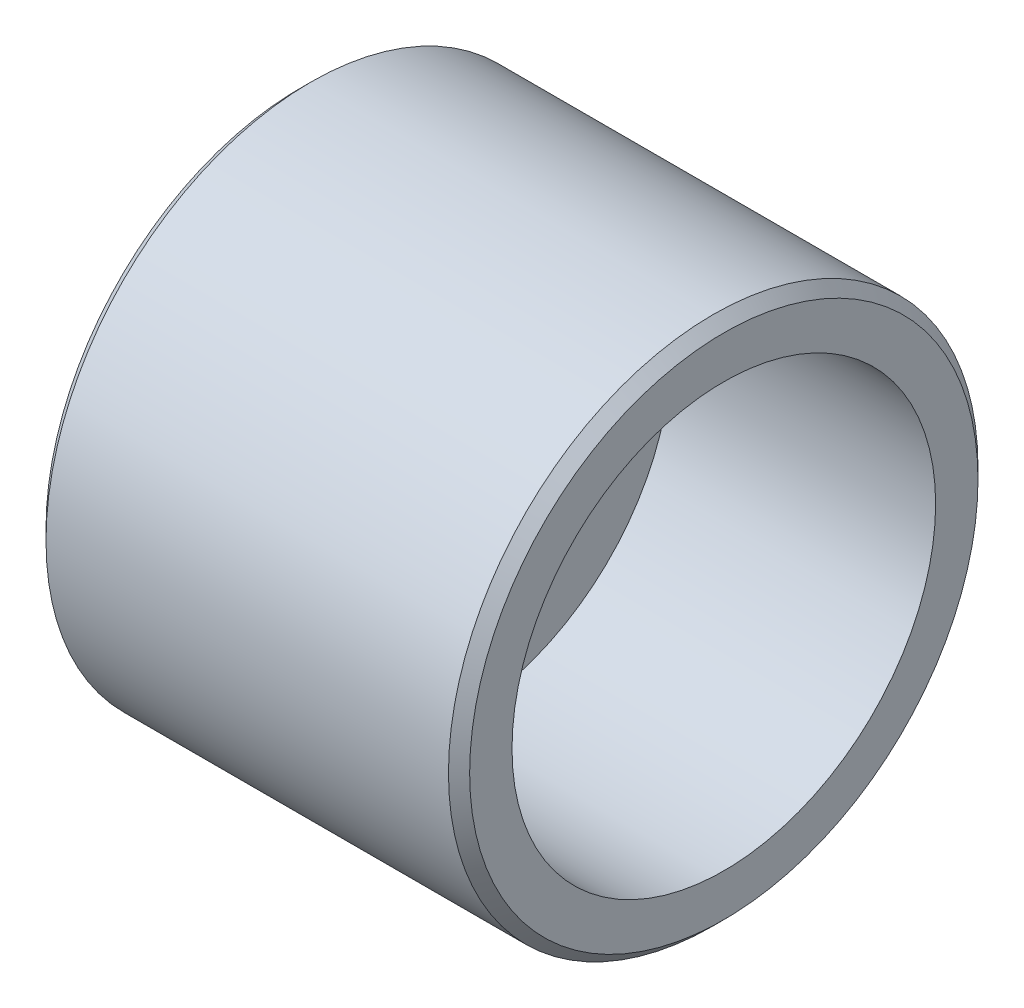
ISO-10303-21;
HEADER;
FILE_DESCRIPTION(('STEP AP214'),'2;1');
FILE_NAME('part.step','',(''),(''),'','','');
FILE_SCHEMA(('AUTOMOTIVE_DESIGN { 1 0 10303 214 1 1 1 1 }'));
ENDSEC;
DATA;
#1=APPLICATION_CONTEXT('core data for automotive mechanical design processes');
#2=APPLICATION_PROTOCOL_DEFINITION('international standard','automotive_design',2000,#1);
#3=PRODUCT_CONTEXT('',#1,'mechanical');
#4=PRODUCT('Part','Part','',(#3));
#5=PRODUCT_RELATED_PRODUCT_CATEGORY('part','',(#4));
#6=PRODUCT_DEFINITION_FORMATION('','',#4);
#7=PRODUCT_DEFINITION_CONTEXT('part definition',#1,'design');
#8=PRODUCT_DEFINITION('design','',#6,#7);
#9=PRODUCT_DEFINITION_SHAPE('','',#8);
#10=(LENGTH_UNIT() NAMED_UNIT(*) SI_UNIT(.MILLI.,.METRE.));
#11=(NAMED_UNIT(*) PLANE_ANGLE_UNIT() SI_UNIT($,.RADIAN.));
#12=(NAMED_UNIT(*) SI_UNIT($,.STERADIAN.) SOLID_ANGLE_UNIT());
#13=UNCERTAINTY_MEASURE_WITH_UNIT(LENGTH_MEASURE(1.E-05),#10,'distance_accuracy_value','');
#14=(GEOMETRIC_REPRESENTATION_CONTEXT(3) GLOBAL_UNCERTAINTY_ASSIGNED_CONTEXT((#13)) GLOBAL_UNIT_ASSIGNED_CONTEXT((#10,
#11,#12)) REPRESENTATION_CONTEXT('',''));
#15=CARTESIAN_POINT('',(0.,0.,0.));
#16=DIRECTION('',(0.,0.,1.));
#17=DIRECTION('',(1.,0.,0.));
#18=AXIS2_PLACEMENT_3D('',#15,#16,#17);
#19=CARTESIAN_POINT('',(0.,16.,0.));
#20=DIRECTION('',(1.,0.,0.));
#21=DIRECTION('',(0.,0.,-1.));
#22=AXIS2_PLACEMENT_3D('',#19,#20,#21);
#23=PLANE('',#22);
#24=CARTESIAN_POINT('',(0.,0.,0.));
#25=DIRECTION('',(1.,0.,0.));
#26=DIRECTION('',(0.,0.,-1.));
#27=AXIS2_PLACEMENT_3D('',#24,#25,#26);
#28=CIRCLE('',#27,24.);
#29=CARTESIAN_POINT('',(0.,0.,-24.));
#30=VERTEX_POINT('',#29);
#31=EDGE_CURVE('E47',#30,#30,#28,.F.);
#32=ORIENTED_EDGE('',*,*,#31,.T.);
#33=EDGE_LOOP('',(#32));
#34=FACE_BOUND('',#33,.T.);
#35=CARTESIAN_POINT('',(0.,0.,0.));
#36=DIRECTION('',(-1.,0.,0.));
#37=DIRECTION('',(0.,0.,1.));
#38=AXIS2_PLACEMENT_3D('',#35,#36,#37);
#39=CIRCLE('',#38,16.);
#40=CARTESIAN_POINT('',(0.,0.,16.));
#41=VERTEX_POINT('',#40);
#42=EDGE_CURVE('E67',#41,#41,#39,.T.);
#43=ORIENTED_EDGE('',*,*,#42,.F.);
#44=EDGE_LOOP('',(#43));
#45=FACE_BOUND('',#44,.T.);
#46=ADVANCED_FACE('F32',(#34,#45),#23,.F.);
#47=CARTESIAN_POINT('',(0.,0.,0.));
#48=DIRECTION('',(-1.,0.,0.));
#49=DIRECTION('',(0.,0.,1.));
#50=AXIS2_PLACEMENT_3D('',#47,#48,#49);
#51=CYLINDRICAL_SURFACE('',#50,25.);
#52=CARTESIAN_POINT('',(1.00000000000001,0.,0.));
#53=DIRECTION('',(1.,0.,0.));
#54=DIRECTION('',(0.,0.,-1.));
#55=AXIS2_PLACEMENT_3D('',#52,#53,#54);
#56=CIRCLE('',#55,25.);
#57=CARTESIAN_POINT('',(1.00000000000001,0.,-25.));
#58=VERTEX_POINT('',#57);
#59=EDGE_CURVE('E39',#58,#58,#56,.T.);
#60=ORIENTED_EDGE('',*,*,#59,.T.);
#61=EDGE_LOOP('',(#60));
#62=FACE_BOUND('',#61,.T.);
#63=CARTESIAN_POINT('',(39.,0.,0.));
#64=DIRECTION('',(-1.,0.,0.));
#65=DIRECTION('',(0.,0.,1.));
#66=AXIS2_PLACEMENT_3D('',#63,#64,#65);
#67=CIRCLE('',#66,25.);
#68=CARTESIAN_POINT('',(39.,0.,25.));
#69=VERTEX_POINT('',#68);
#70=EDGE_CURVE('E43',#69,#69,#67,.T.);
#71=ORIENTED_EDGE('',*,*,#70,.T.);
#72=EDGE_LOOP('',(#71));
#73=FACE_BOUND('',#72,.T.);
#74=ADVANCED_FACE('F74',(#62,#73),#51,.T.);
#75=CARTESIAN_POINT('',(40.,25.,0.));
#76=DIRECTION('',(-1.,0.,0.));
#77=DIRECTION('',(0.,0.,1.));
#78=AXIS2_PLACEMENT_3D('',#75,#76,#77);
#79=PLANE('',#78);
#80=CARTESIAN_POINT('',(40.,0.,0.));
#81=DIRECTION('',(-1.,0.,0.));
#82=DIRECTION('',(0.,0.,1.));
#83=AXIS2_PLACEMENT_3D('',#80,#81,#82);
#84=CIRCLE('',#83,24.);
#85=CARTESIAN_POINT('',(40.,0.,24.));
#86=VERTEX_POINT('',#85);
#87=EDGE_CURVE('E10',#86,#86,#84,.F.);
#88=ORIENTED_EDGE('',*,*,#87,.T.);
#89=EDGE_LOOP('',(#88));
#90=FACE_BOUND('',#89,.T.);
#91=CARTESIAN_POINT('',(40.,0.,0.));
#92=DIRECTION('',(-1.,0.,0.));
#93=DIRECTION('',(0.,0.,1.));
#94=AXIS2_PLACEMENT_3D('',#91,#92,#93);
#95=CIRCLE('',#94,20.);
#96=CARTESIAN_POINT('',(40.,0.,20.));
#97=VERTEX_POINT('',#96);
#98=EDGE_CURVE('E52',#97,#97,#95,.T.);
#99=ORIENTED_EDGE('',*,*,#98,.T.);
#100=EDGE_LOOP('',(#99));
#101=FACE_BOUND('',#100,.T.);
#102=ADVANCED_FACE('F80',(#90,#101),#79,.F.);
#103=CARTESIAN_POINT('',(0.,0.,0.));
#104=DIRECTION('',(-1.,0.,0.));
#105=DIRECTION('',(0.,0.,1.));
#106=AXIS2_PLACEMENT_3D('',#103,#104,#105);
#107=CYLINDRICAL_SURFACE('',#106,20.);
#108=ORIENTED_EDGE('',*,*,#98,.F.);
#109=EDGE_LOOP('',(#108));
#110=FACE_BOUND('',#109,.T.);
#111=CARTESIAN_POINT('',(15.,0.,0.));
#112=DIRECTION('',(-1.,0.,0.));
#113=DIRECTION('',(0.,0.,1.));
#114=AXIS2_PLACEMENT_3D('',#111,#112,#113);
#115=CIRCLE('',#114,20.);
#116=CARTESIAN_POINT('',(15.,0.,20.));
#117=VERTEX_POINT('',#116);
#118=EDGE_CURVE('E55',#117,#117,#115,.T.);
#119=ORIENTED_EDGE('',*,*,#118,.T.);
#120=EDGE_LOOP('',(#119));
#121=FACE_BOUND('',#120,.T.);
#122=ADVANCED_FACE('F110',(#110,#121),#107,.F.);
#123=CARTESIAN_POINT('',(15.,20.,0.));
#124=DIRECTION('',(-1.,0.,0.));
#125=DIRECTION('',(0.,0.,1.));
#126=AXIS2_PLACEMENT_3D('',#123,#124,#125);
#127=PLANE('',#126);
#128=ORIENTED_EDGE('',*,*,#118,.F.);
#129=EDGE_LOOP('',(#128));
#130=FACE_BOUND('',#129,.T.);
#131=CARTESIAN_POINT('',(15.,0.,0.));
#132=DIRECTION('',(-1.,0.,0.));
#133=DIRECTION('',(0.,0.,1.));
#134=AXIS2_PLACEMENT_3D('',#131,#132,#133);
#135=CIRCLE('',#134,12.5);
#136=CARTESIAN_POINT('',(15.,0.,12.5));
#137=VERTEX_POINT('',#136);
#138=EDGE_CURVE('E58',#137,#137,#135,.T.);
#139=ORIENTED_EDGE('',*,*,#138,.T.);
#140=EDGE_LOOP('',(#139));
#141=FACE_BOUND('',#140,.T.);
#142=ADVANCED_FACE('F106',(#130,#141),#127,.F.);
#143=CARTESIAN_POINT('',(0.,0.,0.));
#144=DIRECTION('',(-1.,0.,0.));
#145=DIRECTION('',(0.,0.,1.));
#146=AXIS2_PLACEMENT_3D('',#143,#144,#145);
#147=CYLINDRICAL_SURFACE('',#146,12.5);
#148=ORIENTED_EDGE('',*,*,#138,.F.);
#149=EDGE_LOOP('',(#148));
#150=FACE_BOUND('',#149,.T.);
#151=CARTESIAN_POINT('',(8.,0.,0.));
#152=DIRECTION('',(-1.,0.,0.));
#153=DIRECTION('',(0.,0.,1.));
#154=AXIS2_PLACEMENT_3D('',#151,#152,#153);
#155=CIRCLE('',#154,12.5);
#156=CARTESIAN_POINT('',(8.,0.,12.5));
#157=VERTEX_POINT('',#156);
#158=EDGE_CURVE('E61',#157,#157,#155,.T.);
#159=ORIENTED_EDGE('',*,*,#158,.T.);
#160=EDGE_LOOP('',(#159));
#161=FACE_BOUND('',#160,.T.);
#162=ADVANCED_FACE('F99',(#150,#161),#147,.F.);
#163=CARTESIAN_POINT('',(8.,12.5,0.));
#164=DIRECTION('',(1.,0.,0.));
#165=DIRECTION('',(0.,0.,-1.));
#166=AXIS2_PLACEMENT_3D('',#163,#164,#165);
#167=PLANE('',#166);
#168=ORIENTED_EDGE('',*,*,#158,.F.);
#169=EDGE_LOOP('',(#168));
#170=FACE_BOUND('',#169,.T.);
#171=CARTESIAN_POINT('',(8.,0.,0.));
#172=DIRECTION('',(-1.,0.,0.));
#173=DIRECTION('',(0.,0.,1.));
#174=AXIS2_PLACEMENT_3D('',#171,#172,#173);
#175=CIRCLE('',#174,16.);
#176=CARTESIAN_POINT('',(8.,0.,16.));
#177=VERTEX_POINT('',#176);
#178=EDGE_CURVE('E64',#177,#177,#175,.T.);
#179=ORIENTED_EDGE('',*,*,#178,.T.);
#180=EDGE_LOOP('',(#179));
#181=FACE_BOUND('',#180,.T.);
#182=ADVANCED_FACE('F91',(#170,#181),#167,.F.);
#183=CARTESIAN_POINT('',(0.,0.,0.));
#184=DIRECTION('',(-1.,0.,0.));
#185=DIRECTION('',(0.,0.,1.));
#186=AXIS2_PLACEMENT_3D('',#183,#184,#185);
#187=CYLINDRICAL_SURFACE('',#186,16.);
#188=ORIENTED_EDGE('',*,*,#178,.F.);
#189=EDGE_LOOP('',(#188));
#190=FACE_BOUND('',#189,.T.);
#191=ORIENTED_EDGE('',*,*,#42,.T.);
#192=EDGE_LOOP('',(#191));
#193=FACE_BOUND('',#192,.T.);
#194=ADVANCED_FACE('F71',(#190,#193),#187,.F.);
#195=CARTESIAN_POINT('',(0.,0.,0.));
#196=DIRECTION('',(1.,0.,0.));
#197=DIRECTION('',(0.,0.,-1.));
#198=AXIS2_PLACEMENT_3D('',#195,#196,#197);
#199=CONICAL_SURFACE('',#198,24.,0.785398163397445);
#200=ORIENTED_EDGE('',*,*,#59,.F.);
#201=EDGE_LOOP('',(#200));
#202=FACE_BOUND('',#201,.T.);
#203=ORIENTED_EDGE('',*,*,#31,.F.);
#204=EDGE_LOOP('',(#203));
#205=FACE_BOUND('',#204,.T.);
#206=ADVANCED_FACE('F83',(#202,#205),#199,.T.);
#207=CARTESIAN_POINT('',(39.,0.,0.));
#208=DIRECTION('',(-1.,0.,0.));
#209=DIRECTION('',(0.,0.,1.));
#210=AXIS2_PLACEMENT_3D('',#207,#208,#209);
#211=CONICAL_SURFACE('',#210,25.,0.785398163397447);
#212=ORIENTED_EDGE('',*,*,#87,.F.);
#213=EDGE_LOOP('',(#212));
#214=FACE_BOUND('',#213,.T.);
#215=ORIENTED_EDGE('',*,*,#70,.F.);
#216=EDGE_LOOP('',(#215));
#217=FACE_BOUND('',#216,.T.);
#218=ADVANCED_FACE('F34',(#214,#217),#211,.T.);
#219=CLOSED_SHELL('',(#46,#74,#102,#122,#142,#162,#182,#194,#206,#218));
#220=MANIFOLD_SOLID_BREP('B2',#219);
#221=ADVANCED_BREP_SHAPE_REPRESENTATION('',(#18,#220),#14);
#222=SHAPE_DEFINITION_REPRESENTATION(#9,#221);
ENDSEC;
END-ISO-10303-21;
